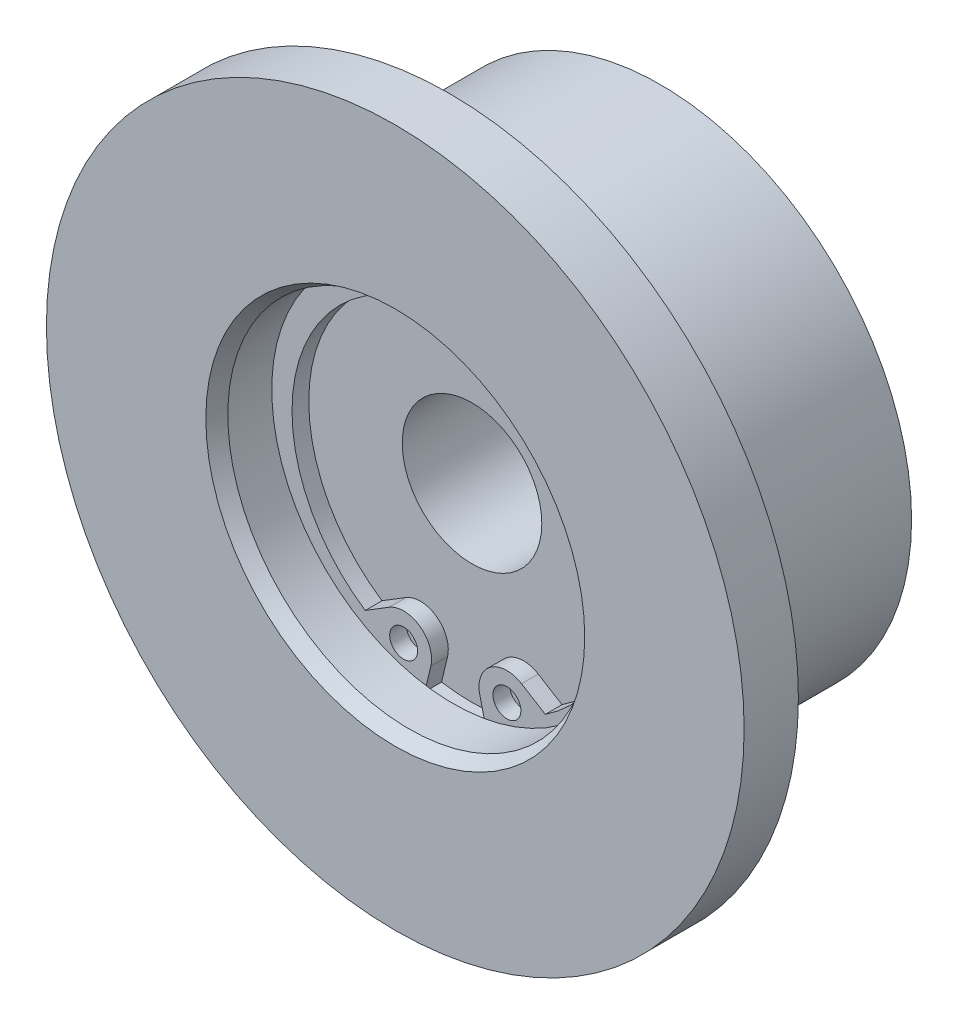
ISO-10303-21;
HEADER;
FILE_DESCRIPTION(('STEP AP214'),'2;1');
FILE_NAME('part.step','',(''),(''),'','','');
FILE_SCHEMA(('AUTOMOTIVE_DESIGN { 1 0 10303 214 1 1 1 1 }'));
ENDSEC;
DATA;
#1=APPLICATION_CONTEXT('core data for automotive mechanical design processes');
#2=APPLICATION_PROTOCOL_DEFINITION('international standard','automotive_design',2000,#1);
#3=PRODUCT_CONTEXT('',#1,'mechanical');
#4=PRODUCT('Part','Part','',(#3));
#5=PRODUCT_RELATED_PRODUCT_CATEGORY('part','',(#4));
#6=PRODUCT_DEFINITION_FORMATION('','',#4);
#7=PRODUCT_DEFINITION_CONTEXT('part definition',#1,'design');
#8=PRODUCT_DEFINITION('design','',#6,#7);
#9=PRODUCT_DEFINITION_SHAPE('','',#8);
#10=(LENGTH_UNIT() NAMED_UNIT(*) SI_UNIT(.MILLI.,.METRE.));
#11=(NAMED_UNIT(*) PLANE_ANGLE_UNIT() SI_UNIT($,.RADIAN.));
#12=(NAMED_UNIT(*) SI_UNIT($,.STERADIAN.) SOLID_ANGLE_UNIT());
#13=UNCERTAINTY_MEASURE_WITH_UNIT(LENGTH_MEASURE(1.E-05),#10,'distance_accuracy_value','');
#14=(GEOMETRIC_REPRESENTATION_CONTEXT(3) GLOBAL_UNCERTAINTY_ASSIGNED_CONTEXT((#13)) GLOBAL_UNIT_ASSIGNED_CONTEXT((#10,
#11,#12)) REPRESENTATION_CONTEXT('',''));
#15=CARTESIAN_POINT('',(0.,0.,0.));
#16=DIRECTION('',(0.,0.,1.));
#17=DIRECTION('',(1.,0.,0.));
#18=AXIS2_PLACEMENT_3D('',#15,#16,#17);
#19=CARTESIAN_POINT('',(0.,5.,4.));
#20=DIRECTION('',(0.,0.,-1.));
#21=DIRECTION('',(-1.,0.,0.));
#22=AXIS2_PLACEMENT_3D('',#19,#20,#21);
#23=PLANE('',#22);
#24=CARTESIAN_POINT('',(3.7,-11.165302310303,4.));
#25=DIRECTION('',(0.,0.,-1.));
#26=DIRECTION('',(-1.,0.,0.));
#27=AXIS2_PLACEMENT_3D('',#24,#25,#26);
#28=CIRCLE('',#27,1.);
#29=CARTESIAN_POINT('',(2.7,-11.165302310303,4.));
#30=VERTEX_POINT('',#29);
#31=EDGE_CURVE('E510',#30,#30,#28,.T.);
#32=ORIENTED_EDGE('',*,*,#31,.F.);
#33=EDGE_LOOP('',(#32));
#34=FACE_BOUND('',#33,.T.);
#35=ADVANCED_FACE('F14',(#34),#23,.F.);
#36=CARTESIAN_POINT('',(-3.7,-11.165302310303,4.));
#37=DIRECTION('',(0.,0.,-1.));
#38=DIRECTION('',(-1.,0.,0.));
#39=AXIS2_PLACEMENT_3D('',#36,#37,#38);
#40=CIRCLE('',#39,1.);
#41=CARTESIAN_POINT('',(-4.7,-11.165302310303,4.));
#42=VERTEX_POINT('',#41);
#43=EDGE_CURVE('E513',#42,#42,#40,.T.);
#44=ORIENTED_EDGE('',*,*,#43,.F.);
#45=EDGE_LOOP('',(#44));
#46=FACE_BOUND('',#45,.T.);
#47=ADVANCED_FACE('F298',(#46),#23,.F.);
#48=CARTESIAN_POINT('',(0.,0.,5.));
#49=DIRECTION('',(0.,0.,1.));
#50=DIRECTION('',(1.,0.,0.));
#51=AXIS2_PLACEMENT_3D('',#48,#49,#50);
#52=CONICAL_SURFACE('',#51,18.,1.48352986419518);
#53=CARTESIAN_POINT('',(0.,0.,5.61242064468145));
#54=DIRECTION('',(0.,0.,1.));
#55=DIRECTION('',(1.,0.,0.));
#56=AXIS2_PLACEMENT_3D('',#53,#54,#55);
#57=CIRCLE('',#56,25.);
#58=CARTESIAN_POINT('',(25.,0.,5.61242064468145));
#59=VERTEX_POINT('',#58);
#60=EDGE_CURVE('E504',#59,#59,#57,.T.);
#61=ORIENTED_EDGE('',*,*,#60,.F.);
#62=EDGE_LOOP('',(#61));
#63=FACE_BOUND('',#62,.T.);
#64=CARTESIAN_POINT('',(0.,0.,5.));
#65=DIRECTION('',(0.,0.,1.));
#66=DIRECTION('',(1.,0.,0.));
#67=AXIS2_PLACEMENT_3D('',#64,#65,#66);
#68=CIRCLE('',#67,18.);
#69=CARTESIAN_POINT('',(18.,0.,5.));
#70=VERTEX_POINT('',#69);
#71=EDGE_CURVE('E507',#70,#70,#68,.T.);
#72=ORIENTED_EDGE('',*,*,#71,.T.);
#73=EDGE_LOOP('',(#72));
#74=FACE_BOUND('',#73,.T.);
#75=ADVANCED_FACE('F317',(#63,#74),#52,.T.);
#76=CARTESIAN_POINT('',(0.,0.,22.1183293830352));
#77=DIRECTION('',(0.,0.,1.));
#78=DIRECTION('',(1.,0.,0.));
#79=AXIS2_PLACEMENT_3D('',#76,#77,#78);
#80=CYLINDRICAL_SURFACE('',#79,25.);
#81=CARTESIAN_POINT('',(0.,0.,9.5));
#82=DIRECTION('',(0.,0.,1.));
#83=DIRECTION('',(1.,0.,0.));
#84=AXIS2_PLACEMENT_3D('',#81,#82,#83);
#85=CIRCLE('',#84,25.);
#86=CARTESIAN_POINT('',(25.,0.,9.5));
#87=VERTEX_POINT('',#86);
#88=EDGE_CURVE('E501',#87,#87,#85,.T.);
#89=ORIENTED_EDGE('',*,*,#88,.F.);
#90=EDGE_LOOP('',(#89));
#91=FACE_BOUND('',#90,.T.);
#92=ORIENTED_EDGE('',*,*,#60,.T.);
#93=EDGE_LOOP('',(#92));
#94=FACE_BOUND('',#93,.T.);
#95=ADVANCED_FACE('F335',(#91,#94),#80,.T.);
#96=CARTESIAN_POINT('',(0.,0.,22.1183293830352));
#97=DIRECTION('',(0.,0.,1.));
#98=DIRECTION('',(1.,0.,0.));
#99=AXIS2_PLACEMENT_3D('',#96,#97,#98);
#100=CYLINDRICAL_SURFACE('',#99,18.);
#101=ORIENTED_EDGE('',*,*,#71,.F.);
#102=EDGE_LOOP('',(#101));
#103=FACE_BOUND('',#102,.T.);
#104=CARTESIAN_POINT('',(0.,0.,-9.5));
#105=DIRECTION('',(0.,0.,1.));
#106=DIRECTION('',(1.,0.,0.));
#107=AXIS2_PLACEMENT_3D('',#104,#105,#106);
#108=CIRCLE('',#107,18.);
#109=CARTESIAN_POINT('',(18.,0.,-9.5));
#110=VERTEX_POINT('',#109);
#111=EDGE_CURVE('E107',#110,#110,#108,.T.);
#112=ORIENTED_EDGE('',*,*,#111,.T.);
#113=EDGE_LOOP('',(#112));
#114=FACE_BOUND('',#113,.T.);
#115=ADVANCED_FACE('F329',(#103,#114),#100,.T.);
#116=CARTESIAN_POINT('',(0.,25.,9.5));
#117=DIRECTION('',(0.,0.,-1.));
#118=DIRECTION('',(-1.,0.,0.));
#119=AXIS2_PLACEMENT_3D('',#116,#117,#118);
#120=PLANE('',#119);
#121=CARTESIAN_POINT('',(0.,0.,9.5));
#122=DIRECTION('',(0.,0.,1.));
#123=DIRECTION('',(1.,0.,0.));
#124=AXIS2_PLACEMENT_3D('',#121,#122,#123);
#125=CIRCLE('',#124,13.5773502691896);
#126=CARTESIAN_POINT('',(13.5773502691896,0.,9.5));
#127=VERTEX_POINT('',#126);
#128=EDGE_CURVE('E498',#127,#127,#125,.T.);
#129=ORIENTED_EDGE('',*,*,#128,.F.);
#130=EDGE_LOOP('',(#129));
#131=FACE_BOUND('',#130,.T.);
#132=ORIENTED_EDGE('',*,*,#88,.T.);
#133=EDGE_LOOP('',(#132));
#134=FACE_BOUND('',#133,.T.);
#135=ADVANCED_FACE('F334',(#131,#134),#120,.F.);
#136=CARTESIAN_POINT('',(0.,11.,-9.5));
#137=DIRECTION('',(0.,0.,1.));
#138=DIRECTION('',(1.,0.,0.));
#139=AXIS2_PLACEMENT_3D('',#136,#137,#138);
#140=PLANE('',#139);
#141=ORIENTED_EDGE('',*,*,#111,.F.);
#142=EDGE_LOOP('',(#141));
#143=FACE_BOUND('',#142,.T.);
#144=CARTESIAN_POINT('',(0.,0.,-9.5));
#145=DIRECTION('',(0.,0.,1.));
#146=DIRECTION('',(1.,0.,0.));
#147=AXIS2_PLACEMENT_3D('',#144,#145,#146);
#148=CIRCLE('',#147,11.);
#149=CARTESIAN_POINT('',(11.,0.,-9.5));
#150=VERTEX_POINT('',#149);
#151=EDGE_CURVE('E473',#150,#150,#148,.T.);
#152=ORIENTED_EDGE('',*,*,#151,.T.);
#153=EDGE_LOOP('',(#152));
#154=FACE_BOUND('',#153,.T.);
#155=ADVANCED_FACE('F359',(#143,#154),#140,.F.);
#156=CARTESIAN_POINT('',(0.,0.,9.5));
#157=DIRECTION('',(0.,0.,1.));
#158=DIRECTION('',(1.,0.,0.));
#159=AXIS2_PLACEMENT_3D('',#156,#157,#158);
#160=CONICAL_SURFACE('',#159,13.5773502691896,0.5235987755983);
#161=CARTESIAN_POINT('',(0.,0.,8.5));
#162=DIRECTION('',(0.,0.,1.));
#163=DIRECTION('',(1.,0.,0.));
#164=AXIS2_PLACEMENT_3D('',#161,#162,#163);
#165=CIRCLE('',#164,13.);
#166=CARTESIAN_POINT('',(13.,0.,8.5));
#167=VERTEX_POINT('',#166);
#168=EDGE_CURVE('E495',#167,#167,#165,.T.);
#169=ORIENTED_EDGE('',*,*,#168,.F.);
#170=EDGE_LOOP('',(#169));
#171=FACE_BOUND('',#170,.T.);
#172=ORIENTED_EDGE('',*,*,#128,.T.);
#173=EDGE_LOOP('',(#172));
#174=FACE_BOUND('',#173,.T.);
#175=ADVANCED_FACE('F365',(#171,#174),#160,.F.);
#176=CARTESIAN_POINT('',(0.,0.,22.1183293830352));
#177=DIRECTION('',(0.,0.,1.));
#178=DIRECTION('',(1.,0.,0.));
#179=AXIS2_PLACEMENT_3D('',#176,#177,#178);
#180=CYLINDRICAL_SURFACE('',#179,11.);
#181=ORIENTED_EDGE('',*,*,#151,.F.);
#182=EDGE_LOOP('',(#181));
#183=FACE_BOUND('',#182,.T.);
#184=CARTESIAN_POINT('',(0.,0.,-4.));
#185=DIRECTION('',(0.,0.,1.));
#186=DIRECTION('',(1.,0.,0.));
#187=AXIS2_PLACEMENT_3D('',#184,#185,#186);
#188=CIRCLE('',#187,11.);
#189=CARTESIAN_POINT('',(11.,0.,-4.));
#190=VERTEX_POINT('',#189);
#191=EDGE_CURVE('E474',#190,#190,#188,.T.);
#192=ORIENTED_EDGE('',*,*,#191,.T.);
#193=EDGE_LOOP('',(#192));
#194=FACE_BOUND('',#193,.T.);
#195=ADVANCED_FACE('F370',(#183,#194),#180,.F.);
#196=CARTESIAN_POINT('',(0.,0.,22.1183293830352));
#197=DIRECTION('',(0.,0.,1.));
#198=DIRECTION('',(1.,0.,0.));
#199=AXIS2_PLACEMENT_3D('',#196,#197,#198);
#200=CYLINDRICAL_SURFACE('',#199,13.);
#201=CARTESIAN_POINT('',(0.,0.,5.35));
#202=DIRECTION('',(0.,0.,1.));
#203=DIRECTION('',(1.,0.,0.));
#204=AXIS2_PLACEMENT_3D('',#201,#202,#203);
#205=CIRCLE('',#204,13.);
#206=CARTESIAN_POINT('',(13.,0.,5.35));
#207=VERTEX_POINT('',#206);
#208=EDGE_CURVE('E492',#207,#207,#205,.T.);
#209=ORIENTED_EDGE('',*,*,#208,.F.);
#210=EDGE_LOOP('',(#209));
#211=FACE_BOUND('',#210,.T.);
#212=ORIENTED_EDGE('',*,*,#168,.T.);
#213=EDGE_LOOP('',(#212));
#214=FACE_BOUND('',#213,.T.);
#215=ADVANCED_FACE('F376',(#211,#214),#200,.F.);
#216=CARTESIAN_POINT('',(0.,11.,-4.));
#217=DIRECTION('',(0.,0.,1.));
#218=DIRECTION('',(1.,0.,0.));
#219=AXIS2_PLACEMENT_3D('',#216,#217,#218);
#220=PLANE('',#219);
#221=ORIENTED_EDGE('',*,*,#191,.F.);
#222=EDGE_LOOP('',(#221));
#223=FACE_BOUND('',#222,.T.);
#224=CARTESIAN_POINT('',(0.,0.,-4.));
#225=DIRECTION('',(0.,0.,1.));
#226=DIRECTION('',(1.,0.,0.));
#227=AXIS2_PLACEMENT_3D('',#224,#225,#226);
#228=CIRCLE('',#227,5.);
#229=CARTESIAN_POINT('',(5.,0.,-4.));
#230=VERTEX_POINT('',#229);
#231=EDGE_CURVE('E477',#230,#230,#228,.T.);
#232=ORIENTED_EDGE('',*,*,#231,.T.);
#233=EDGE_LOOP('',(#232));
#234=FACE_BOUND('',#233,.T.);
#235=ADVANCED_FACE('F381',(#223,#234),#220,.F.);
#236=CARTESIAN_POINT('',(0.,13.6,5.35));
#237=DIRECTION('',(0.,0.,1.));
#238=DIRECTION('',(1.,0.,0.));
#239=AXIS2_PLACEMENT_3D('',#236,#237,#238);
#240=PLANE('',#239);
#241=CARTESIAN_POINT('',(0.,0.,5.35));
#242=DIRECTION('',(0.,0.,1.));
#243=DIRECTION('',(1.,0.,0.));
#244=AXIS2_PLACEMENT_3D('',#241,#242,#243);
#245=CIRCLE('',#244,13.6);
#246=CARTESIAN_POINT('',(13.6,0.,5.35));
#247=VERTEX_POINT('',#246);
#248=EDGE_CURVE('E489',#247,#247,#245,.T.);
#249=ORIENTED_EDGE('',*,*,#248,.F.);
#250=EDGE_LOOP('',(#249));
#251=FACE_BOUND('',#250,.T.);
#252=ORIENTED_EDGE('',*,*,#208,.T.);
#253=EDGE_LOOP('',(#252));
#254=FACE_BOUND('',#253,.T.);
#255=ADVANCED_FACE('F307',(#251,#254),#240,.F.);
#256=CARTESIAN_POINT('',(0.,0.,22.1183293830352));
#257=DIRECTION('',(0.,0.,1.));
#258=DIRECTION('',(1.,0.,0.));
#259=AXIS2_PLACEMENT_3D('',#256,#257,#258);
#260=CYLINDRICAL_SURFACE('',#259,13.6);
#261=ORIENTED_EDGE('',*,*,#248,.T.);
#262=EDGE_LOOP('',(#261));
#263=FACE_BOUND('',#262,.T.);
#264=DIRECTION('',(0.,0.,1.));
#265=VECTOR('',#264,1.);
#266=CARTESIAN_POINT('',(2.1813307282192,-13.4239262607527,22.1183293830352));
#267=LINE('',#266,#265);
#268=CARTESIAN_POINT('',(2.1813307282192,-13.4239262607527,4.));
#269=VERTEX_POINT('',#268);
#270=CARTESIAN_POINT('',(2.1813307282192,-13.4239262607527,5.2));
#271=VERTEX_POINT('',#270);
#272=EDGE_CURVE('E9',#269,#271,#267,.T.);
#273=ORIENTED_EDGE('',*,*,#272,.F.);
#274=CARTESIAN_POINT('',(0.,0.,4.));
#275=DIRECTION('',(0.,0.,1.));
#276=DIRECTION('',(1.,0.,0.));
#277=AXIS2_PLACEMENT_3D('',#274,#275,#276);
#278=CIRCLE('',#277,13.6);
#279=CARTESIAN_POINT('',(-2.18133072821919,-13.4239262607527,4.));
#280=VERTEX_POINT('',#279);
#281=EDGE_CURVE('E486',#280,#269,#278,.T.);
#282=ORIENTED_EDGE('',*,*,#281,.F.);
#283=DIRECTION('',(0.,0.,1.));
#284=VECTOR('',#283,1.);
#285=CARTESIAN_POINT('',(-2.18133072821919,-13.4239262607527,22.1183293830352));
#286=LINE('',#285,#284);
#287=CARTESIAN_POINT('',(-2.18133072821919,-13.4239262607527,5.2));
#288=VERTEX_POINT('',#287);
#289=EDGE_CURVE('E109',#288,#280,#286,.F.);
#290=ORIENTED_EDGE('',*,*,#289,.F.);
#291=CARTESIAN_POINT('',(0.,0.,5.2));
#292=DIRECTION('',(0.,0.,-1.));
#293=DIRECTION('',(-1.,0.,0.));
#294=AXIS2_PLACEMENT_3D('',#291,#292,#293);
#295=CIRCLE('',#294,13.6);
#296=EDGE_CURVE('E23',#271,#288,#295,.F.);
#297=ORIENTED_EDGE('',*,*,#296,.F.);
#298=EDGE_LOOP('',(#273,#282,#290,#297));
#299=FACE_BOUND('',#298,.T.);
#300=ADVANCED_FACE('F302',(#263,#299),#260,.F.);
#301=CARTESIAN_POINT('',(0.,0.,22.1183293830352));
#302=DIRECTION('',(0.,0.,1.));
#303=DIRECTION('',(1.,0.,0.));
#304=AXIS2_PLACEMENT_3D('',#301,#302,#303);
#305=CYLINDRICAL_SURFACE('',#304,5.);
#306=ORIENTED_EDGE('',*,*,#231,.F.);
#307=EDGE_LOOP('',(#306));
#308=FACE_BOUND('',#307,.T.);
#309=CARTESIAN_POINT('',(0.,0.,4.));
#310=DIRECTION('',(0.,0.,1.));
#311=DIRECTION('',(1.,0.,0.));
#312=AXIS2_PLACEMENT_3D('',#309,#310,#311);
#313=CIRCLE('',#312,5.);
#314=CARTESIAN_POINT('',(5.,0.,4.));
#315=VERTEX_POINT('',#314);
#316=EDGE_CURVE('E483',#315,#315,#313,.T.);
#317=ORIENTED_EDGE('',*,*,#316,.T.);
#318=EDGE_LOOP('',(#317));
#319=FACE_BOUND('',#318,.T.);
#320=ADVANCED_FACE('F295',(#308,#319),#305,.F.);
#321=ORIENTED_EDGE('',*,*,#316,.F.);
#322=EDGE_LOOP('',(#321));
#323=FACE_BOUND('',#322,.T.);
#324=DIRECTION('',(0.231349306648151,-0.972870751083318,0.));
#325=VECTOR('',#324,1.);
#326=CARTESIAN_POINT('',(-2.08214742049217,4.50486396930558,4.));
#327=LINE('',#326,#325);
#328=CARTESIAN_POINT('',(1.75425849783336,-11.6280009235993,4.));
#329=VERTEX_POINT('',#328);
#330=EDGE_CURVE('E111',#329,#269,#327,.T.);
#331=ORIENTED_EDGE('',*,*,#330,.F.);
#332=CARTESIAN_POINT('',(3.7,-11.165302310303,4.));
#333=DIRECTION('',(0.,0.,-1.));
#334=DIRECTION('',(-1.,0.,0.));
#335=AXIS2_PLACEMENT_3D('',#332,#333,#334);
#336=CIRCLE('',#335,2.);
#337=CARTESIAN_POINT('',(4.74866968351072,-9.46227797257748,4.));
#338=VERTEX_POINT('',#337);
#339=EDGE_CURVE('E89',#329,#338,#336,.T.);
#340=ORIENTED_EDGE('',*,*,#339,.T.);
#341=DIRECTION('',(-0.851512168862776,0.524334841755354,0.));
#342=VECTOR('',#341,1.);
#343=CARTESIAN_POINT('',(-5.1515440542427,-3.36603273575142,4.));
#344=LINE('',#343,#342);
#345=CARTESIAN_POINT('',(6.45127454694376,-10.5106893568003,4.));
#346=VERTEX_POINT('',#345);
#347=EDGE_CURVE('E124',#346,#338,#344,.T.);
#348=ORIENTED_EDGE('',*,*,#347,.F.);
#349=CARTESIAN_POINT('',(0.,-0.75,4.));
#350=DIRECTION('',(0.,0.,-1.));
#351=DIRECTION('',(-1.,0.,0.));
#352=AXIS2_PLACEMENT_3D('',#349,#350,#351);
#353=CIRCLE('',#352,11.7);
#354=CARTESIAN_POINT('',(-6.45127454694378,-10.5106893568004,4.));
#355=VERTEX_POINT('',#354);
#356=EDGE_CURVE('E528',#355,#346,#353,.T.);
#357=ORIENTED_EDGE('',*,*,#356,.F.);
#358=DIRECTION('',(-0.851512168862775,-0.524334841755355,0.));
#359=VECTOR('',#358,1.);
#360=CARTESIAN_POINT('',(5.1515440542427,-3.3660327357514,4.));
#361=LINE('',#360,#359);
#362=CARTESIAN_POINT('',(-4.74866968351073,-9.46227797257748,4.));
#363=VERTEX_POINT('',#362);
#364=EDGE_CURVE('E524',#363,#355,#361,.T.);
#365=ORIENTED_EDGE('',*,*,#364,.F.);
#366=CARTESIAN_POINT('',(-3.7,-11.165302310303,4.));
#367=DIRECTION('',(0.,0.,-1.));
#368=DIRECTION('',(-1.,0.,0.));
#369=AXIS2_PLACEMENT_3D('',#366,#367,#368);
#370=CIRCLE('',#369,2.);
#371=CARTESIAN_POINT('',(-1.75425849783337,-11.6280009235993,4.));
#372=VERTEX_POINT('',#371);
#373=EDGE_CURVE('E517',#363,#372,#370,.T.);
#374=ORIENTED_EDGE('',*,*,#373,.T.);
#375=DIRECTION('',(0.231349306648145,0.97287075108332,0.));
#376=VECTOR('',#375,1.);
#377=CARTESIAN_POINT('',(2.08214742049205,4.50486396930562,4.));
#378=LINE('',#377,#376);
#379=EDGE_CURVE('E521',#280,#372,#378,.T.);
#380=ORIENTED_EDGE('',*,*,#379,.F.);
#381=ORIENTED_EDGE('',*,*,#281,.T.);
#382=EDGE_LOOP('',(#331,#340,#348,#357,#365,#374,#380,#381));
#383=FACE_BOUND('',#382,.T.);
#384=ADVANCED_FACE('F217',(#323,#383),#23,.F.);
#385=CARTESIAN_POINT('',(0.,-0.75,5.2));
#386=DIRECTION('',(0.,0.,1.));
#387=DIRECTION('',(-1.,0.,0.));
#388=AXIS2_PLACEMENT_3D('',#385,#386,#387);
#389=CYLINDRICAL_SURFACE('',#388,11.7);
#390=ORIENTED_EDGE('',*,*,#356,.T.);
#391=DIRECTION('',(0.,0.,-1.));
#392=VECTOR('',#391,1.);
#393=CARTESIAN_POINT('',(6.45127454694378,-10.5106893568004,5.2));
#394=LINE('',#393,#392);
#395=CARTESIAN_POINT('',(6.45127454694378,-10.5106893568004,5.2));
#396=VERTEX_POINT('',#395);
#397=EDGE_CURVE('E128',#396,#346,#394,.T.);
#398=ORIENTED_EDGE('',*,*,#397,.F.);
#399=CARTESIAN_POINT('',(0.,-0.75,5.2));
#400=DIRECTION('',(0.,0.,-1.));
#401=DIRECTION('',(0.,-1.,0.));
#402=AXIS2_PLACEMENT_3D('',#399,#400,#401);
#403=CIRCLE('',#402,11.7);
#404=CARTESIAN_POINT('',(-6.45127454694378,-10.5106893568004,5.2));
#405=VERTEX_POINT('',#404);
#406=EDGE_CURVE('E136',#405,#396,#403,.T.);
#407=ORIENTED_EDGE('',*,*,#406,.F.);
#408=DIRECTION('',(0.,0.,-1.));
#409=VECTOR('',#408,1.);
#410=CARTESIAN_POINT('',(-6.45127454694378,-10.5106893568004,5.2));
#411=LINE('',#410,#409);
#412=EDGE_CURVE('E108',#405,#355,#411,.T.);
#413=ORIENTED_EDGE('',*,*,#412,.T.);
#414=EDGE_LOOP('',(#390,#398,#407,#413));
#415=FACE_BOUND('',#414,.T.);
#416=ADVANCED_FACE('F16',(#415),#389,.F.);
#417=CARTESIAN_POINT('',(4.74866968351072,-9.46227797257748,5.2));
#418=DIRECTION('',(-0.524334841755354,-0.851512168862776,0.));
#419=DIRECTION('',(-0.851512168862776,0.524334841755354,0.));
#420=AXIS2_PLACEMENT_3D('',#417,#418,#419);
#421=PLANE('',#420);
#422=ORIENTED_EDGE('',*,*,#347,.T.);
#423=DIRECTION('',(0.,0.,-1.));
#424=VECTOR('',#423,1.);
#425=CARTESIAN_POINT('',(4.74866968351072,-9.46227797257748,5.2));
#426=LINE('',#425,#424);
#427=CARTESIAN_POINT('',(4.74866968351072,-9.46227797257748,5.2));
#428=VERTEX_POINT('',#427);
#429=EDGE_CURVE('E91',#428,#338,#426,.T.);
#430=ORIENTED_EDGE('',*,*,#429,.F.);
#431=DIRECTION('',(-0.851512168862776,0.524334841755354,0.));
#432=VECTOR('',#431,1.);
#433=CARTESIAN_POINT('',(4.74866968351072,-9.46227797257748,5.2));
#434=LINE('',#433,#432);
#435=EDGE_CURVE('E81',#396,#428,#434,.T.);
#436=ORIENTED_EDGE('',*,*,#435,.F.);
#437=ORIENTED_EDGE('',*,*,#397,.T.);
#438=EDGE_LOOP('',(#422,#430,#436,#437));
#439=FACE_BOUND('',#438,.T.);
#440=ADVANCED_FACE('F201',(#439),#421,.F.);
#441=CARTESIAN_POINT('',(3.7,-11.165302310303,5.2));
#442=DIRECTION('',(0.,0.,1.));
#443=DIRECTION('',(-1.,0.,0.));
#444=AXIS2_PLACEMENT_3D('',#441,#442,#443);
#445=CYLINDRICAL_SURFACE('',#444,2.);
#446=ORIENTED_EDGE('',*,*,#339,.F.);
#447=DIRECTION('',(0.,0.,-1.));
#448=VECTOR('',#447,1.);
#449=CARTESIAN_POINT('',(1.75425849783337,-11.6280009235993,5.2));
#450=LINE('',#449,#448);
#451=CARTESIAN_POINT('',(1.75425849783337,-11.6280009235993,5.2));
#452=VERTEX_POINT('',#451);
#453=EDGE_CURVE('E73',#452,#329,#450,.T.);
#454=ORIENTED_EDGE('',*,*,#453,.F.);
#455=CARTESIAN_POINT('',(3.7,-11.165302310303,5.2));
#456=DIRECTION('',(0.,0.,1.));
#457=DIRECTION('',(1.,0.,0.));
#458=AXIS2_PLACEMENT_3D('',#455,#456,#457);
#459=CIRCLE('',#458,2.);
#460=EDGE_CURVE('E75',#428,#452,#459,.T.);
#461=ORIENTED_EDGE('',*,*,#460,.F.);
#462=ORIENTED_EDGE('',*,*,#429,.T.);
#463=EDGE_LOOP('',(#446,#454,#461,#462));
#464=FACE_BOUND('',#463,.T.);
#465=ADVANCED_FACE('F87',(#464),#445,.T.);
#466=CARTESIAN_POINT('',(-1.75425849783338,-11.6280009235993,5.2));
#467=DIRECTION('',(-0.97287075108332,0.231349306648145,0.));
#468=DIRECTION('',(0.,0.,1.));
#469=AXIS2_PLACEMENT_3D('',#466,#467,#468);
#470=PLANE('',#469);
#471=DIRECTION('',(0.231349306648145,0.97287075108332,0.));
#472=VECTOR('',#471,1.);
#473=CARTESIAN_POINT('',(-1.75425849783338,-11.6280009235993,5.2));
#474=LINE('',#473,#472);
#475=CARTESIAN_POINT('',(-1.75425849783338,-11.6280009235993,5.2));
#476=VERTEX_POINT('',#475);
#477=EDGE_CURVE('E61',#288,#476,#474,.T.);
#478=ORIENTED_EDGE('',*,*,#477,.F.);
#479=ORIENTED_EDGE('',*,*,#289,.T.);
#480=ORIENTED_EDGE('',*,*,#379,.T.);
#481=DIRECTION('',(0.,0.,-1.));
#482=VECTOR('',#481,1.);
#483=CARTESIAN_POINT('',(-1.75425849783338,-11.6280009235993,5.2));
#484=LINE('',#483,#482);
#485=EDGE_CURVE('E92',#476,#372,#484,.T.);
#486=ORIENTED_EDGE('',*,*,#485,.F.);
#487=EDGE_LOOP('',(#478,#479,#480,#486));
#488=FACE_BOUND('',#487,.T.);
#489=ADVANCED_FACE('F200',(#488),#470,.F.);
#490=CARTESIAN_POINT('',(0.,-0.75,5.2));
#491=DIRECTION('',(0.,0.,-1.));
#492=DIRECTION('',(0.,-1.,0.));
#493=AXIS2_PLACEMENT_3D('',#490,#491,#492);
#494=PLANE('',#493);
#495=CARTESIAN_POINT('',(-3.7,-11.165302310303,5.2));
#496=DIRECTION('',(0.,0.,-1.));
#497=DIRECTION('',(1.,0.,0.));
#498=AXIS2_PLACEMENT_3D('',#495,#496,#497);
#499=CIRCLE('',#498,1.);
#500=CARTESIAN_POINT('',(-2.7,-11.165302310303,5.2));
#501=VERTEX_POINT('',#500);
#502=EDGE_CURVE('E97',#501,#501,#499,.T.);
#503=ORIENTED_EDGE('',*,*,#502,.T.);
#504=EDGE_LOOP('',(#503));
#505=FACE_BOUND('',#504,.T.);
#506=CARTESIAN_POINT('',(3.7,-11.165302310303,5.2));
#507=DIRECTION('',(0.,0.,1.));
#508=DIRECTION('',(1.,0.,0.));
#509=AXIS2_PLACEMENT_3D('',#506,#507,#508);
#510=CIRCLE('',#509,1.);
#511=CARTESIAN_POINT('',(4.7,-11.165302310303,5.2));
#512=VERTEX_POINT('',#511);
#513=EDGE_CURVE('E100',#512,#512,#510,.T.);
#514=ORIENTED_EDGE('',*,*,#513,.F.);
#515=EDGE_LOOP('',(#514));
#516=FACE_BOUND('',#515,.T.);
#517=DIRECTION('',(0.231349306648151,-0.972870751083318,0.));
#518=VECTOR('',#517,1.);
#519=CARTESIAN_POINT('',(1.75425849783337,-11.6280009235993,5.2));
#520=LINE('',#519,#518);
#521=EDGE_CURVE('E68',#452,#271,#520,.T.);
#522=ORIENTED_EDGE('',*,*,#521,.T.);
#523=ORIENTED_EDGE('',*,*,#296,.T.);
#524=ORIENTED_EDGE('',*,*,#477,.T.);
#525=CARTESIAN_POINT('',(-3.7,-11.165302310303,5.2));
#526=DIRECTION('',(0.,0.,1.));
#527=DIRECTION('',(-1.,0.,0.));
#528=AXIS2_PLACEMENT_3D('',#525,#526,#527);
#529=CIRCLE('',#528,2.);
#530=CARTESIAN_POINT('',(-4.74866968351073,-9.46227797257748,5.2));
#531=VERTEX_POINT('',#530);
#532=EDGE_CURVE('E133',#476,#531,#529,.T.);
#533=ORIENTED_EDGE('',*,*,#532,.T.);
#534=DIRECTION('',(-0.851512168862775,-0.524334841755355,0.));
#535=VECTOR('',#534,1.);
#536=CARTESIAN_POINT('',(-4.74866968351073,-9.46227797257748,5.2));
#537=LINE('',#536,#535);
#538=EDGE_CURVE('E131',#531,#405,#537,.T.);
#539=ORIENTED_EDGE('',*,*,#538,.T.);
#540=ORIENTED_EDGE('',*,*,#406,.T.);
#541=ORIENTED_EDGE('',*,*,#435,.T.);
#542=ORIENTED_EDGE('',*,*,#460,.T.);
#543=EDGE_LOOP('',(#522,#523,#524,#533,#539,#540,#541,#542));
#544=FACE_BOUND('',#543,.T.);
#545=ADVANCED_FACE('F79',(#505,#516,#544),#494,.F.);
#546=CARTESIAN_POINT('',(3.7,-11.165302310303,5.2));
#547=DIRECTION('',(0.,0.,1.));
#548=DIRECTION('',(-1.,0.,0.));
#549=AXIS2_PLACEMENT_3D('',#546,#547,#548);
#550=CYLINDRICAL_SURFACE('',#549,1.);
#551=ORIENTED_EDGE('',*,*,#31,.T.);
#552=EDGE_LOOP('',(#551));
#553=FACE_BOUND('',#552,.T.);
#554=ORIENTED_EDGE('',*,*,#513,.T.);
#555=EDGE_LOOP('',(#554));
#556=FACE_BOUND('',#555,.T.);
#557=ADVANCED_FACE('F167',(#553,#556),#550,.F.);
#558=CARTESIAN_POINT('',(-3.7,-11.165302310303,5.2));
#559=DIRECTION('',(0.,0.,1.));
#560=DIRECTION('',(-1.,0.,0.));
#561=AXIS2_PLACEMENT_3D('',#558,#559,#560);
#562=CYLINDRICAL_SURFACE('',#561,1.);
#563=ORIENTED_EDGE('',*,*,#43,.T.);
#564=EDGE_LOOP('',(#563));
#565=FACE_BOUND('',#564,.T.);
#566=ORIENTED_EDGE('',*,*,#502,.F.);
#567=EDGE_LOOP('',(#566));
#568=FACE_BOUND('',#567,.T.);
#569=ADVANCED_FACE('F172',(#565,#568),#562,.F.);
#570=CARTESIAN_POINT('',(-4.74866968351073,-9.46227797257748,5.2));
#571=DIRECTION('',(0.524334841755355,-0.851512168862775,0.));
#572=DIRECTION('',(0.,0.,-1.));
#573=AXIS2_PLACEMENT_3D('',#570,#571,#572);
#574=PLANE('',#573);
#575=ORIENTED_EDGE('',*,*,#364,.T.);
#576=ORIENTED_EDGE('',*,*,#412,.F.);
#577=ORIENTED_EDGE('',*,*,#538,.F.);
#578=DIRECTION('',(0.,0.,-1.));
#579=VECTOR('',#578,1.);
#580=CARTESIAN_POINT('',(-4.74866968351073,-9.46227797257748,5.2));
#581=LINE('',#580,#579);
#582=EDGE_CURVE('E104',#531,#363,#581,.T.);
#583=ORIENTED_EDGE('',*,*,#582,.T.);
#584=EDGE_LOOP('',(#575,#576,#577,#583));
#585=FACE_BOUND('',#584,.T.);
#586=ADVANCED_FACE('F182',(#585),#574,.F.);
#587=CARTESIAN_POINT('',(-3.7,-11.165302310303,5.2));
#588=DIRECTION('',(0.,0.,1.));
#589=DIRECTION('',(-1.,0.,0.));
#590=AXIS2_PLACEMENT_3D('',#587,#588,#589);
#591=CYLINDRICAL_SURFACE('',#590,2.);
#592=ORIENTED_EDGE('',*,*,#373,.F.);
#593=ORIENTED_EDGE('',*,*,#582,.F.);
#594=ORIENTED_EDGE('',*,*,#532,.F.);
#595=ORIENTED_EDGE('',*,*,#485,.T.);
#596=EDGE_LOOP('',(#592,#593,#594,#595));
#597=FACE_BOUND('',#596,.T.);
#598=ADVANCED_FACE('F188',(#597),#591,.T.);
#599=CARTESIAN_POINT('',(1.75425849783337,-11.6280009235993,5.2));
#600=DIRECTION('',(0.972870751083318,0.231349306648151,0.));
#601=DIRECTION('',(0.,0.,-1.));
#602=AXIS2_PLACEMENT_3D('',#599,#600,#601);
#603=PLANE('',#602);
#604=ORIENTED_EDGE('',*,*,#330,.T.);
#605=ORIENTED_EDGE('',*,*,#272,.T.);
#606=ORIENTED_EDGE('',*,*,#521,.F.);
#607=ORIENTED_EDGE('',*,*,#453,.T.);
#608=EDGE_LOOP('',(#604,#605,#606,#607));
#609=FACE_BOUND('',#608,.T.);
#610=ADVANCED_FACE('F71',(#609),#603,.F.);
#611=CLOSED_SHELL('',(#35,#47,#75,#95,#115,#135,#155,#175,#195,#215,#235,#255,#300,#320,#384,
#416,#440,#465,#489,#545,#557,#569,#586,#598,#610));
#612=MANIFOLD_SOLID_BREP('B1',#611);
#613=ADVANCED_BREP_SHAPE_REPRESENTATION('',(#18,#612),#14);
#614=SHAPE_DEFINITION_REPRESENTATION(#9,#613);
ENDSEC;
END-ISO-10303-21;
